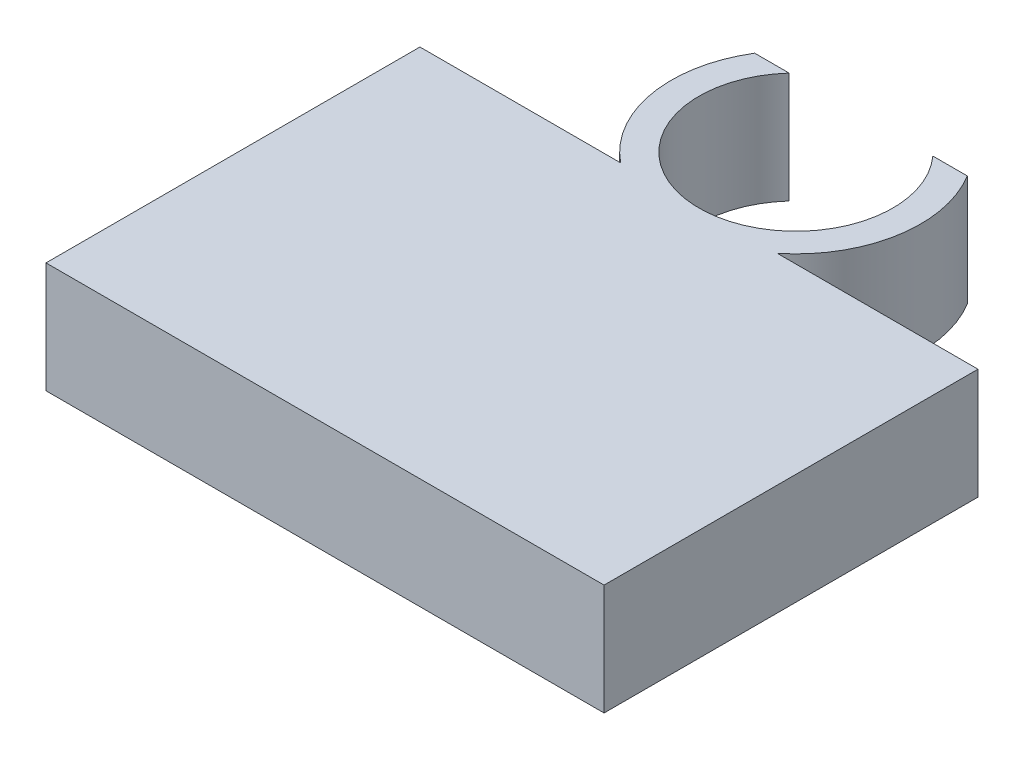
ISO-10303-21;
HEADER;
FILE_DESCRIPTION(('STEP AP214'),'2;1');
FILE_NAME('part.step','',(''),(''),'','','');
FILE_SCHEMA(('AUTOMOTIVE_DESIGN { 1 0 10303 214 1 1 1 1 }'));
ENDSEC;
DATA;
#1=APPLICATION_CONTEXT('core data for automotive mechanical design processes');
#2=APPLICATION_PROTOCOL_DEFINITION('international standard','automotive_design',2000,#1);
#3=PRODUCT_CONTEXT('',#1,'mechanical');
#4=PRODUCT('Part','Part','',(#3));
#5=PRODUCT_RELATED_PRODUCT_CATEGORY('part','',(#4));
#6=PRODUCT_DEFINITION_FORMATION('','',#4);
#7=PRODUCT_DEFINITION_CONTEXT('part definition',#1,'design');
#8=PRODUCT_DEFINITION('design','',#6,#7);
#9=PRODUCT_DEFINITION_SHAPE('','',#8);
#10=(LENGTH_UNIT() NAMED_UNIT(*) SI_UNIT(.MILLI.,.METRE.));
#11=(NAMED_UNIT(*) PLANE_ANGLE_UNIT() SI_UNIT($,.RADIAN.));
#12=(NAMED_UNIT(*) SI_UNIT($,.STERADIAN.) SOLID_ANGLE_UNIT());
#13=UNCERTAINTY_MEASURE_WITH_UNIT(LENGTH_MEASURE(1.E-05),#10,'distance_accuracy_value','');
#14=(GEOMETRIC_REPRESENTATION_CONTEXT(3) GLOBAL_UNCERTAINTY_ASSIGNED_CONTEXT((#13)) GLOBAL_UNIT_ASSIGNED_CONTEXT((#10,
#11,#12)) REPRESENTATION_CONTEXT('',''));
#15=CARTESIAN_POINT('',(0.,0.,0.));
#16=DIRECTION('',(0.,0.,1.));
#17=DIRECTION('',(1.,0.,0.));
#18=AXIS2_PLACEMENT_3D('',#15,#16,#17);
#19=CARTESIAN_POINT('',(0.,2.,0.));
#20=DIRECTION('',(0.,-1.,0.));
#21=DIRECTION('',(0.,0.,-1.));
#22=AXIS2_PLACEMENT_3D('',#19,#20,#21);
#23=CYLINDRICAL_SURFACE('',#22,2.25);
#24=CARTESIAN_POINT('',(0.,2.,0.));
#25=DIRECTION('',(0.,1.,0.));
#26=DIRECTION('',(0.,0.,1.));
#27=AXIS2_PLACEMENT_3D('',#24,#25,#26);
#28=CIRCLE('',#27,2.25);
#29=CARTESIAN_POINT('',(-1.918999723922,2.,-1.17470849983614));
#30=VERTEX_POINT('',#29);
#31=CARTESIAN_POINT('',(-1.41421356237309,2.,1.75));
#32=VERTEX_POINT('',#31);
#33=EDGE_CURVE('E52',#30,#32,#28,.T.);
#34=ORIENTED_EDGE('',*,*,#33,.F.);
#35=DIRECTION('',(0.,-1.,0.));
#36=VECTOR('',#35,1.);
#37=CARTESIAN_POINT('',(-1.918999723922,2.,-1.17470849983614));
#38=LINE('',#37,#36);
#39=CARTESIAN_POINT('',(-1.918999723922,0.,-1.17470849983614));
#40=VERTEX_POINT('',#39);
#41=EDGE_CURVE('E157',#30,#40,#38,.T.);
#42=ORIENTED_EDGE('',*,*,#41,.T.);
#43=CARTESIAN_POINT('',(0.,0.,0.));
#44=DIRECTION('',(0.,1.,0.));
#45=DIRECTION('',(0.,0.,1.));
#46=AXIS2_PLACEMENT_3D('',#43,#44,#45);
#47=CIRCLE('',#46,2.25);
#48=CARTESIAN_POINT('',(-1.41421356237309,0.,1.75));
#49=VERTEX_POINT('',#48);
#50=EDGE_CURVE('E198',#40,#49,#47,.T.);
#51=ORIENTED_EDGE('',*,*,#50,.T.);
#52=DIRECTION('',(0.,1.,0.));
#53=VECTOR('',#52,1.);
#54=CARTESIAN_POINT('',(-1.41421356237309,0.,1.75));
#55=LINE('',#54,#53);
#56=EDGE_CURVE('E189',#49,#32,#55,.T.);
#57=ORIENTED_EDGE('',*,*,#56,.T.);
#58=EDGE_LOOP('',(#34,#42,#51,#57));
#59=FACE_BOUND('',#58,.T.);
#60=ADVANCED_FACE('F43',(#59),#23,.T.);
#61=CARTESIAN_POINT('',(1.41421356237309,0.,1.75));
#62=VERTEX_POINT('',#61);
#63=CARTESIAN_POINT('',(1.918999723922,0.,-1.17470849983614));
#64=VERTEX_POINT('',#63);
#65=EDGE_CURVE('E47',#62,#64,#47,.T.);
#66=ORIENTED_EDGE('',*,*,#65,.T.);
#67=DIRECTION('',(0.,-1.,0.));
#68=VECTOR('',#67,1.);
#69=CARTESIAN_POINT('',(1.918999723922,2.,-1.17470849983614));
#70=LINE('',#69,#68);
#71=CARTESIAN_POINT('',(1.918999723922,2.,-1.17470849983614));
#72=VERTEX_POINT('',#71);
#73=EDGE_CURVE('E171',#72,#64,#70,.T.);
#74=ORIENTED_EDGE('',*,*,#73,.F.);
#75=CARTESIAN_POINT('',(1.41421356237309,2.,1.75));
#76=VERTEX_POINT('',#75);
#77=EDGE_CURVE('E11',#76,#72,#28,.T.);
#78=ORIENTED_EDGE('',*,*,#77,.F.);
#79=DIRECTION('',(0.,1.,0.));
#80=VECTOR('',#79,1.);
#81=CARTESIAN_POINT('',(1.41421356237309,0.,1.75));
#82=LINE('',#81,#80);
#83=EDGE_CURVE('E192',#62,#76,#82,.T.);
#84=ORIENTED_EDGE('',*,*,#83,.F.);
#85=EDGE_LOOP('',(#66,#74,#78,#84));
#86=FACE_BOUND('',#85,.T.);
#87=ADVANCED_FACE('F45',(#86),#23,.T.);
#88=CARTESIAN_POINT('',(0.,2.,0.));
#89=DIRECTION('',(0.,1.,0.));
#90=DIRECTION('',(0.,0.,1.));
#91=AXIS2_PLACEMENT_3D('',#88,#89,#90);
#92=PLANE('',#91);
#93=CARTESIAN_POINT('',(0.,2.,0.));
#94=DIRECTION('',(0.,1.,0.));
#95=DIRECTION('',(0.,0.,1.));
#96=AXIS2_PLACEMENT_3D('',#93,#94,#95);
#97=CIRCLE('',#96,1.75);
#98=CARTESIAN_POINT('',(-1.29713528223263,2.,-1.17470849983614));
#99=VERTEX_POINT('',#98);
#100=CARTESIAN_POINT('',(1.29713528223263,2.,-1.17470849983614));
#101=VERTEX_POINT('',#100);
#102=EDGE_CURVE('E196',#99,#101,#97,.T.);
#103=ORIENTED_EDGE('',*,*,#102,.F.);
#104=DIRECTION('',(1.,0.,0.));
#105=VECTOR('',#104,1.);
#106=CARTESIAN_POINT('',(0.,2.,-1.17470849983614));
#107=LINE('',#106,#105);
#108=EDGE_CURVE('E154',#30,#99,#107,.T.);
#109=ORIENTED_EDGE('',*,*,#108,.F.);
#110=ORIENTED_EDGE('',*,*,#33,.T.);
#111=DIRECTION('',(1.,0.,0.));
#112=VECTOR('',#111,1.);
#113=CARTESIAN_POINT('',(0.,2.,1.75));
#114=LINE('',#113,#112);
#115=CARTESIAN_POINT('',(-5.03702893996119,2.,1.75));
#116=VERTEX_POINT('',#115);
#117=EDGE_CURVE('E184',#116,#32,#114,.T.);
#118=ORIENTED_EDGE('',*,*,#117,.F.);
#119=DIRECTION('',(0.,0.,1.));
#120=VECTOR('',#119,1.);
#121=CARTESIAN_POINT('',(-5.03702893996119,2.,0.));
#122=LINE('',#121,#120);
#123=CARTESIAN_POINT('',(-5.03702893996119,2.,8.49999999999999));
#124=VERTEX_POINT('',#123);
#125=EDGE_CURVE('E179',#116,#124,#122,.T.);
#126=ORIENTED_EDGE('',*,*,#125,.T.);
#127=DIRECTION('',(1.,0.,0.));
#128=VECTOR('',#127,1.);
#129=CARTESIAN_POINT('',(-5.03702893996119,2.,8.49999999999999));
#130=LINE('',#129,#128);
#131=CARTESIAN_POINT('',(5.03702893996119,2.,8.49999999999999));
#132=VERTEX_POINT('',#131);
#133=EDGE_CURVE('E142',#124,#132,#130,.T.);
#134=ORIENTED_EDGE('',*,*,#133,.T.);
#135=DIRECTION('',(0.,0.,1.));
#136=VECTOR('',#135,1.);
#137=CARTESIAN_POINT('',(5.03702893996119,2.,0.));
#138=LINE('',#137,#136);
#139=CARTESIAN_POINT('',(5.03702893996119,2.,1.75));
#140=VERTEX_POINT('',#139);
#141=EDGE_CURVE('E165',#140,#132,#138,.T.);
#142=ORIENTED_EDGE('',*,*,#141,.F.);
#143=DIRECTION('',(1.,0.,0.));
#144=VECTOR('',#143,1.);
#145=CARTESIAN_POINT('',(0.,2.,1.75));
#146=LINE('',#145,#144);
#147=EDGE_CURVE('E58',#76,#140,#146,.T.);
#148=ORIENTED_EDGE('',*,*,#147,.F.);
#149=ORIENTED_EDGE('',*,*,#77,.T.);
#150=DIRECTION('',(1.,0.,0.));
#151=VECTOR('',#150,1.);
#152=CARTESIAN_POINT('',(0.,2.,-1.17470849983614));
#153=LINE('',#152,#151);
#154=EDGE_CURVE('E168',#101,#72,#153,.T.);
#155=ORIENTED_EDGE('',*,*,#154,.F.);
#156=EDGE_LOOP('',(#103,#109,#110,#118,#126,#134,#142,#148,#149,#155));
#157=FACE_BOUND('',#156,.T.);
#158=ADVANCED_FACE('F216',(#157),#92,.T.);
#159=CARTESIAN_POINT('',(0.,0.,0.));
#160=DIRECTION('',(0.,1.,0.));
#161=DIRECTION('',(0.,0.,1.));
#162=AXIS2_PLACEMENT_3D('',#159,#160,#161);
#163=PLANE('',#162);
#164=ORIENTED_EDGE('',*,*,#50,.F.);
#165=DIRECTION('',(1.,0.,0.));
#166=VECTOR('',#165,1.);
#167=CARTESIAN_POINT('',(0.,0.,-1.17470849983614));
#168=LINE('',#167,#166);
#169=CARTESIAN_POINT('',(-1.29713528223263,0.,-1.17470849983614));
#170=VERTEX_POINT('',#169);
#171=EDGE_CURVE('E158',#40,#170,#168,.T.);
#172=ORIENTED_EDGE('',*,*,#171,.T.);
#173=CARTESIAN_POINT('',(0.,0.,0.));
#174=DIRECTION('',(0.,1.,0.));
#175=DIRECTION('',(0.,0.,1.));
#176=AXIS2_PLACEMENT_3D('',#173,#174,#175);
#177=CIRCLE('',#176,1.75);
#178=CARTESIAN_POINT('',(1.29713528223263,0.,-1.17470849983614));
#179=VERTEX_POINT('',#178);
#180=EDGE_CURVE('E188',#170,#179,#177,.T.);
#181=ORIENTED_EDGE('',*,*,#180,.T.);
#182=DIRECTION('',(1.,0.,0.));
#183=VECTOR('',#182,1.);
#184=CARTESIAN_POINT('',(0.,0.,-1.17470849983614));
#185=LINE('',#184,#183);
#186=EDGE_CURVE('E152',#179,#64,#185,.T.);
#187=ORIENTED_EDGE('',*,*,#186,.T.);
#188=ORIENTED_EDGE('',*,*,#65,.F.);
#189=DIRECTION('',(1.,0.,0.));
#190=VECTOR('',#189,1.);
#191=CARTESIAN_POINT('',(0.,0.,1.75));
#192=LINE('',#191,#190);
#193=CARTESIAN_POINT('',(5.03702893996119,0.,1.75));
#194=VERTEX_POINT('',#193);
#195=EDGE_CURVE('E90',#62,#194,#192,.T.);
#196=ORIENTED_EDGE('',*,*,#195,.T.);
#197=DIRECTION('',(0.,0.,1.));
#198=VECTOR('',#197,1.);
#199=CARTESIAN_POINT('',(5.03702893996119,0.,0.));
#200=LINE('',#199,#198);
#201=CARTESIAN_POINT('',(5.03702893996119,0.,8.49999999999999));
#202=VERTEX_POINT('',#201);
#203=EDGE_CURVE('E147',#194,#202,#200,.T.);
#204=ORIENTED_EDGE('',*,*,#203,.T.);
#205=DIRECTION('',(1.,0.,0.));
#206=VECTOR('',#205,1.);
#207=CARTESIAN_POINT('',(-5.03702893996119,0.,8.49999999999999));
#208=LINE('',#207,#206);
#209=CARTESIAN_POINT('',(-5.03702893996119,0.,8.49999999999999));
#210=VERTEX_POINT('',#209);
#211=EDGE_CURVE('E140',#210,#202,#208,.T.);
#212=ORIENTED_EDGE('',*,*,#211,.F.);
#213=DIRECTION('',(0.,0.,1.));
#214=VECTOR('',#213,1.);
#215=CARTESIAN_POINT('',(-5.03702893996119,0.,0.));
#216=LINE('',#215,#214);
#217=CARTESIAN_POINT('',(-5.03702893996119,0.,1.75));
#218=VERTEX_POINT('',#217);
#219=EDGE_CURVE('E126',#218,#210,#216,.T.);
#220=ORIENTED_EDGE('',*,*,#219,.F.);
#221=DIRECTION('',(1.,0.,0.));
#222=VECTOR('',#221,1.);
#223=CARTESIAN_POINT('',(0.,0.,1.75));
#224=LINE('',#223,#222);
#225=EDGE_CURVE('E134',#218,#49,#224,.T.);
#226=ORIENTED_EDGE('',*,*,#225,.T.);
#227=EDGE_LOOP('',(#164,#172,#181,#187,#188,#196,#204,#212,#220,#226));
#228=FACE_BOUND('',#227,.T.);
#229=ADVANCED_FACE('F145',(#228),#163,.F.);
#230=CARTESIAN_POINT('',(0.,2.,0.));
#231=DIRECTION('',(0.,-1.,0.));
#232=DIRECTION('',(0.,0.,-1.));
#233=AXIS2_PLACEMENT_3D('',#230,#231,#232);
#234=CYLINDRICAL_SURFACE('',#233,1.75);
#235=ORIENTED_EDGE('',*,*,#180,.F.);
#236=DIRECTION('',(0.,-1.,0.));
#237=VECTOR('',#236,1.);
#238=CARTESIAN_POINT('',(-1.29713528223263,2.,-1.17470849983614));
#239=LINE('',#238,#237);
#240=EDGE_CURVE('E162',#99,#170,#239,.T.);
#241=ORIENTED_EDGE('',*,*,#240,.F.);
#242=ORIENTED_EDGE('',*,*,#102,.T.);
#243=DIRECTION('',(0.,-1.,0.));
#244=VECTOR('',#243,1.);
#245=CARTESIAN_POINT('',(1.29713528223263,2.,-1.17470849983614));
#246=LINE('',#245,#244);
#247=EDGE_CURVE('E161',#101,#179,#246,.T.);
#248=ORIENTED_EDGE('',*,*,#247,.T.);
#249=EDGE_LOOP('',(#235,#241,#242,#248));
#250=FACE_BOUND('',#249,.T.);
#251=ADVANCED_FACE('F204',(#250),#234,.F.);
#252=CARTESIAN_POINT('',(5.03702893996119,0.,0.));
#253=DIRECTION('',(-1.,0.,0.));
#254=DIRECTION('',(0.,0.,1.));
#255=AXIS2_PLACEMENT_3D('',#252,#253,#254);
#256=PLANE('',#255);
#257=ORIENTED_EDGE('',*,*,#141,.T.);
#258=DIRECTION('',(0.,1.,0.));
#259=VECTOR('',#258,1.);
#260=CARTESIAN_POINT('',(5.03702893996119,0.,8.49999999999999));
#261=LINE('',#260,#259);
#262=EDGE_CURVE('E143',#202,#132,#261,.T.);
#263=ORIENTED_EDGE('',*,*,#262,.F.);
#264=ORIENTED_EDGE('',*,*,#203,.F.);
#265=DIRECTION('',(0.,1.,0.));
#266=VECTOR('',#265,1.);
#267=CARTESIAN_POINT('',(5.03702893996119,0.,1.75));
#268=LINE('',#267,#266);
#269=EDGE_CURVE('E133',#194,#140,#268,.T.);
#270=ORIENTED_EDGE('',*,*,#269,.T.);
#271=EDGE_LOOP('',(#257,#263,#264,#270));
#272=FACE_BOUND('',#271,.T.);
#273=ADVANCED_FACE('F245',(#272),#256,.F.);
#274=CARTESIAN_POINT('',(-5.03702893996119,0.,0.));
#275=DIRECTION('',(-1.,0.,0.));
#276=DIRECTION('',(0.,0.,1.));
#277=AXIS2_PLACEMENT_3D('',#274,#275,#276);
#278=PLANE('',#277);
#279=ORIENTED_EDGE('',*,*,#125,.F.);
#280=DIRECTION('',(0.,1.,0.));
#281=VECTOR('',#280,1.);
#282=CARTESIAN_POINT('',(-5.03702893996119,0.,1.75));
#283=LINE('',#282,#281);
#284=EDGE_CURVE('E67',#218,#116,#283,.T.);
#285=ORIENTED_EDGE('',*,*,#284,.F.);
#286=ORIENTED_EDGE('',*,*,#219,.T.);
#287=DIRECTION('',(0.,1.,0.));
#288=VECTOR('',#287,1.);
#289=CARTESIAN_POINT('',(-5.03702893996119,0.,8.49999999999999));
#290=LINE('',#289,#288);
#291=EDGE_CURVE('E129',#210,#124,#290,.T.);
#292=ORIENTED_EDGE('',*,*,#291,.T.);
#293=EDGE_LOOP('',(#279,#285,#286,#292));
#294=FACE_BOUND('',#293,.T.);
#295=ADVANCED_FACE('F128',(#294),#278,.T.);
#296=CARTESIAN_POINT('',(0.,0.,1.75));
#297=DIRECTION('',(0.,0.,1.));
#298=DIRECTION('',(1.,0.,0.));
#299=AXIS2_PLACEMENT_3D('',#296,#297,#298);
#300=PLANE('',#299);
#301=ORIENTED_EDGE('',*,*,#117,.T.);
#302=ORIENTED_EDGE('',*,*,#56,.F.);
#303=ORIENTED_EDGE('',*,*,#225,.F.);
#304=ORIENTED_EDGE('',*,*,#284,.T.);
#305=EDGE_LOOP('',(#301,#302,#303,#304));
#306=FACE_BOUND('',#305,.T.);
#307=ADVANCED_FACE('F215',(#306),#300,.F.);
#308=CARTESIAN_POINT('',(0.,0.,1.75));
#309=DIRECTION('',(0.,0.,1.));
#310=DIRECTION('',(1.,0.,0.));
#311=AXIS2_PLACEMENT_3D('',#308,#309,#310);
#312=PLANE('',#311);
#313=ORIENTED_EDGE('',*,*,#147,.T.);
#314=ORIENTED_EDGE('',*,*,#269,.F.);
#315=ORIENTED_EDGE('',*,*,#195,.F.);
#316=ORIENTED_EDGE('',*,*,#83,.T.);
#317=EDGE_LOOP('',(#313,#314,#315,#316));
#318=FACE_BOUND('',#317,.T.);
#319=ADVANCED_FACE('F221',(#318),#312,.F.);
#320=CARTESIAN_POINT('',(0.,2.,-1.17470849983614));
#321=DIRECTION('',(0.,0.,-1.));
#322=DIRECTION('',(-1.,0.,0.));
#323=AXIS2_PLACEMENT_3D('',#320,#321,#322);
#324=PLANE('',#323);
#325=ORIENTED_EDGE('',*,*,#171,.F.);
#326=ORIENTED_EDGE('',*,*,#41,.F.);
#327=ORIENTED_EDGE('',*,*,#108,.T.);
#328=ORIENTED_EDGE('',*,*,#240,.T.);
#329=EDGE_LOOP('',(#325,#326,#327,#328));
#330=FACE_BOUND('',#329,.T.);
#331=ADVANCED_FACE('F219',(#330),#324,.T.);
#332=CARTESIAN_POINT('',(0.,2.,-1.17470849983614));
#333=DIRECTION('',(0.,0.,-1.));
#334=DIRECTION('',(-1.,0.,0.));
#335=AXIS2_PLACEMENT_3D('',#332,#333,#334);
#336=PLANE('',#335);
#337=ORIENTED_EDGE('',*,*,#186,.F.);
#338=ORIENTED_EDGE('',*,*,#247,.F.);
#339=ORIENTED_EDGE('',*,*,#154,.T.);
#340=ORIENTED_EDGE('',*,*,#73,.T.);
#341=EDGE_LOOP('',(#337,#338,#339,#340));
#342=FACE_BOUND('',#341,.T.);
#343=ADVANCED_FACE('F207',(#342),#336,.T.);
#344=CARTESIAN_POINT('',(-5.03702893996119,0.,8.49999999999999));
#345=DIRECTION('',(0.,0.,1.));
#346=DIRECTION('',(1.,0.,0.));
#347=AXIS2_PLACEMENT_3D('',#344,#345,#346);
#348=PLANE('',#347);
#349=ORIENTED_EDGE('',*,*,#133,.F.);
#350=ORIENTED_EDGE('',*,*,#291,.F.);
#351=ORIENTED_EDGE('',*,*,#211,.T.);
#352=ORIENTED_EDGE('',*,*,#262,.T.);
#353=EDGE_LOOP('',(#349,#350,#351,#352));
#354=FACE_BOUND('',#353,.T.);
#355=ADVANCED_FACE('F138',(#354),#348,.T.);
#356=CLOSED_SHELL('',(#60,#87,#158,#229,#251,#273,#295,#307,#319,#331,#343,#355));
#357=MANIFOLD_SOLID_BREP('B2',#356);
#358=ADVANCED_BREP_SHAPE_REPRESENTATION('',(#18,#357),#14);
#359=SHAPE_DEFINITION_REPRESENTATION(#9,#358);
ENDSEC;
END-ISO-10303-21;
